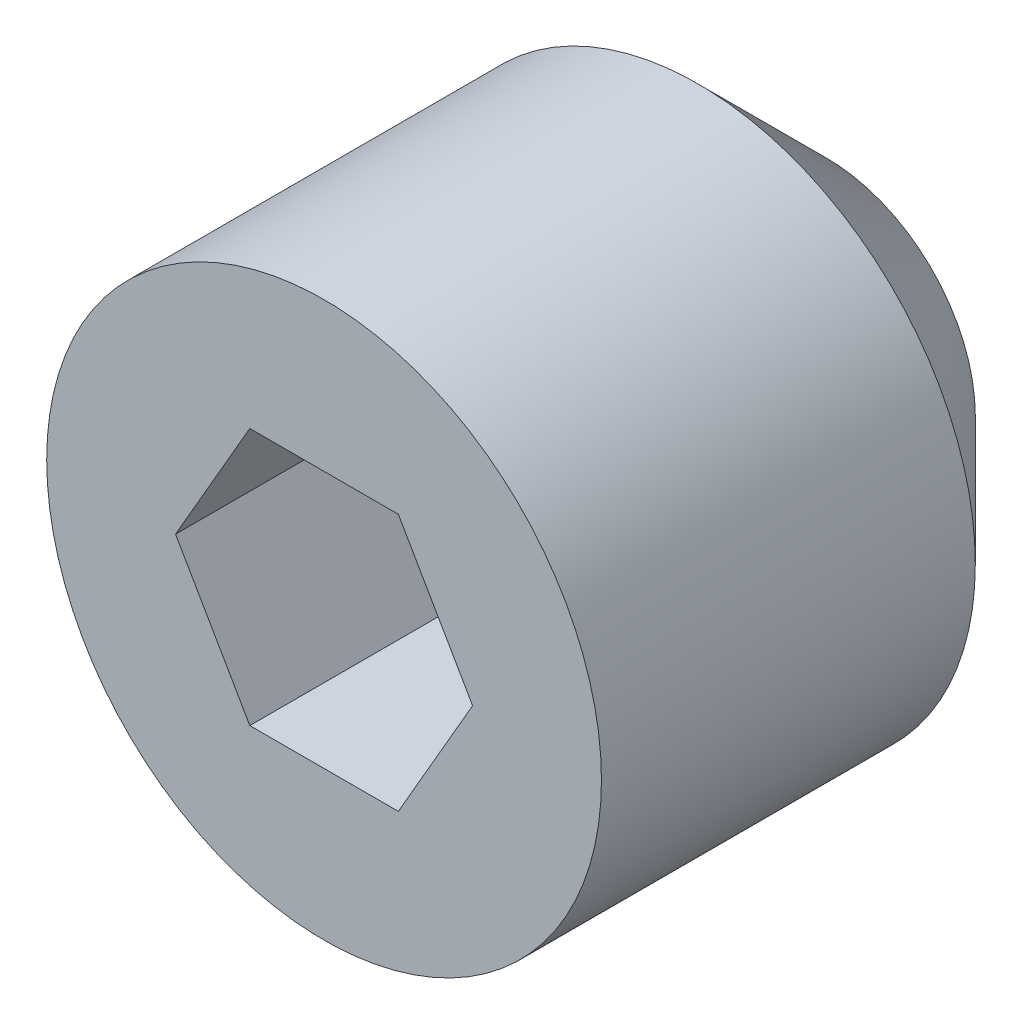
ISO-10303-21;
HEADER;
FILE_DESCRIPTION(('STEP AP214'),'2;1');
FILE_NAME('part.step','',(''),(''),'','','');
FILE_SCHEMA(('AUTOMOTIVE_DESIGN { 1 0 10303 214 1 1 1 1 }'));
ENDSEC;
DATA;
#1=APPLICATION_CONTEXT('core data for automotive mechanical design processes');
#2=APPLICATION_PROTOCOL_DEFINITION('international standard','automotive_design',2000,#1);
#3=PRODUCT_CONTEXT('',#1,'mechanical');
#4=PRODUCT('Part','Part','',(#3));
#5=PRODUCT_RELATED_PRODUCT_CATEGORY('part','',(#4));
#6=PRODUCT_DEFINITION_FORMATION('','',#4);
#7=PRODUCT_DEFINITION_CONTEXT('part definition',#1,'design');
#8=PRODUCT_DEFINITION('design','',#6,#7);
#9=PRODUCT_DEFINITION_SHAPE('','',#8);
#10=(LENGTH_UNIT() NAMED_UNIT(*) SI_UNIT(.MILLI.,.METRE.));
#11=(NAMED_UNIT(*) PLANE_ANGLE_UNIT() SI_UNIT($,.RADIAN.));
#12=(NAMED_UNIT(*) SI_UNIT($,.STERADIAN.) SOLID_ANGLE_UNIT());
#13=UNCERTAINTY_MEASURE_WITH_UNIT(LENGTH_MEASURE(1.E-05),#10,'distance_accuracy_value','');
#14=(GEOMETRIC_REPRESENTATION_CONTEXT(3) GLOBAL_UNCERTAINTY_ASSIGNED_CONTEXT((#13)) GLOBAL_UNIT_ASSIGNED_CONTEXT((#10,
#11,#12)) REPRESENTATION_CONTEXT('',''));
#15=CARTESIAN_POINT('',(0.,0.,0.));
#16=DIRECTION('',(0.,0.,1.));
#17=DIRECTION('',(1.,0.,0.));
#18=AXIS2_PLACEMENT_3D('',#15,#16,#17);
#19=CARTESIAN_POINT('',(0.,0.,0.));
#20=DIRECTION('',(0.,0.,-1.));
#21=DIRECTION('',(-1.,0.,0.));
#22=AXIS2_PLACEMENT_3D('',#19,#20,#21);
#23=PLANE('',#22);
#24=DIRECTION('',(-0.5,0.866025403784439,0.));
#25=VECTOR('',#24,1.);
#26=CARTESIAN_POINT('',(0.938540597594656,0.,0.));
#27=LINE('',#26,#25);
#28=CARTESIAN_POINT('',(0.938540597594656,0.,0.));
#29=VERTEX_POINT('',#28);
#30=CARTESIAN_POINT('',(0.469270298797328,0.8128,0.));
#31=VERTEX_POINT('',#30);
#32=EDGE_CURVE('E98',#29,#31,#27,.T.);
#33=ORIENTED_EDGE('',*,*,#32,.F.);
#34=DIRECTION('',(0.5,0.866025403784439,0.));
#35=VECTOR('',#34,1.);
#36=CARTESIAN_POINT('',(0.469270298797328,-0.8128,0.));
#37=LINE('',#36,#35);
#38=CARTESIAN_POINT('',(0.469270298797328,-0.8128,0.));
#39=VERTEX_POINT('',#38);
#40=EDGE_CURVE('E44',#39,#29,#37,.T.);
#41=ORIENTED_EDGE('',*,*,#40,.F.);
#42=DIRECTION('',(1.,0.,0.));
#43=VECTOR('',#42,1.);
#44=CARTESIAN_POINT('',(-0.469270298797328,-0.8128,0.));
#45=LINE('',#44,#43);
#46=CARTESIAN_POINT('',(-0.469270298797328,-0.8128,0.));
#47=VERTEX_POINT('',#46);
#48=EDGE_CURVE('E113',#47,#39,#45,.T.);
#49=ORIENTED_EDGE('',*,*,#48,.F.);
#50=DIRECTION('',(0.5,-0.866025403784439,0.));
#51=VECTOR('',#50,1.);
#52=CARTESIAN_POINT('',(-0.938540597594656,0.,0.));
#53=LINE('',#52,#51);
#54=CARTESIAN_POINT('',(-0.938540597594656,0.,0.));
#55=VERTEX_POINT('',#54);
#56=EDGE_CURVE('E107',#55,#47,#53,.T.);
#57=ORIENTED_EDGE('',*,*,#56,.F.);
#58=DIRECTION('',(-0.5,-0.866025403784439,0.));
#59=VECTOR('',#58,1.);
#60=CARTESIAN_POINT('',(-0.469270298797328,0.8128,0.));
#61=LINE('',#60,#59);
#62=CARTESIAN_POINT('',(-0.469270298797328,0.8128,0.));
#63=VERTEX_POINT('',#62);
#64=EDGE_CURVE('E105',#63,#55,#61,.T.);
#65=ORIENTED_EDGE('',*,*,#64,.F.);
#66=DIRECTION('',(-1.,0.,0.));
#67=VECTOR('',#66,1.);
#68=CARTESIAN_POINT('',(0.469270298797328,0.8128,0.));
#69=LINE('',#68,#67);
#70=EDGE_CURVE('E87',#31,#63,#69,.T.);
#71=ORIENTED_EDGE('',*,*,#70,.F.);
#72=EDGE_LOOP('',(#33,#41,#49,#57,#65,#71));
#73=FACE_BOUND('',#72,.T.);
#74=CARTESIAN_POINT('',(0.,0.,0.));
#75=DIRECTION('',(0.,0.,1.));
#76=DIRECTION('',(1.,0.,0.));
#77=AXIS2_PLACEMENT_3D('',#74,#75,#76);
#78=CIRCLE('',#77,1.7526);
#79=CARTESIAN_POINT('',(1.7526,0.,0.));
#80=VERTEX_POINT('',#79);
#81=EDGE_CURVE('E11',#80,#80,#78,.T.);
#82=ORIENTED_EDGE('',*,*,#81,.T.);
#83=EDGE_LOOP('',(#82));
#84=FACE_BOUND('',#83,.T.);
#85=ADVANCED_FACE('F30',(#73,#84),#23,.F.);
#86=CARTESIAN_POINT('',(0.,0.,19.7862277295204));
#87=DIRECTION('',(0.,0.,1.));
#88=DIRECTION('',(1.,0.,0.));
#89=AXIS2_PLACEMENT_3D('',#86,#87,#88);
#90=CYLINDRICAL_SURFACE('',#89,1.7526);
#91=ORIENTED_EDGE('',*,*,#81,.F.);
#92=EDGE_LOOP('',(#91));
#93=FACE_BOUND('',#92,.T.);
#94=CARTESIAN_POINT('',(0.,0.,-2.3622));
#95=DIRECTION('',(0.,0.,1.));
#96=DIRECTION('',(1.,0.,0.));
#97=AXIS2_PLACEMENT_3D('',#94,#95,#96);
#98=CIRCLE('',#97,1.7526);
#99=CARTESIAN_POINT('',(1.7526,0.,-2.3622));
#100=VERTEX_POINT('',#99);
#101=EDGE_CURVE('E37',#100,#100,#98,.T.);
#102=ORIENTED_EDGE('',*,*,#101,.T.);
#103=EDGE_LOOP('',(#102));
#104=FACE_BOUND('',#103,.T.);
#105=ADVANCED_FACE('F142',(#93,#104),#90,.T.);
#106=CARTESIAN_POINT('',(0.,0.,-3.175));
#107=DIRECTION('',(0.,0.,1.));
#108=DIRECTION('',(1.,0.,0.));
#109=AXIS2_PLACEMENT_3D('',#106,#107,#108);
#110=CONICAL_SURFACE('',#109,0.9398,0.785398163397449);
#111=ORIENTED_EDGE('',*,*,#101,.F.);
#112=EDGE_LOOP('',(#111));
#113=FACE_BOUND('',#112,.T.);
#114=CARTESIAN_POINT('',(0.,0.,-3.175));
#115=DIRECTION('',(0.,0.,1.));
#116=DIRECTION('',(1.,0.,0.));
#117=AXIS2_PLACEMENT_3D('',#114,#115,#116);
#118=CIRCLE('',#117,0.9398);
#119=CARTESIAN_POINT('',(0.9398,0.,-3.175));
#120=VERTEX_POINT('',#119);
#121=EDGE_CURVE('E131',#120,#120,#118,.T.);
#122=ORIENTED_EDGE('',*,*,#121,.T.);
#123=EDGE_LOOP('',(#122));
#124=FACE_BOUND('',#123,.T.);
#125=ADVANCED_FACE('F144',(#113,#124),#110,.T.);
#126=CARTESIAN_POINT('',(0.,0.9398,-3.175));
#127=DIRECTION('',(0.,0.,1.));
#128=DIRECTION('',(1.,0.,0.));
#129=AXIS2_PLACEMENT_3D('',#126,#127,#128);
#130=PLANE('',#129);
#131=ORIENTED_EDGE('',*,*,#121,.F.);
#132=EDGE_LOOP('',(#131));
#133=FACE_BOUND('',#132,.T.);
#134=ADVANCED_FACE('F147',(#133),#130,.F.);
#135=CARTESIAN_POINT('',(0.469270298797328,-0.8128,-1.27));
#136=DIRECTION('',(0.866025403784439,-0.5,0.));
#137=DIRECTION('',(0.5,0.866025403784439,0.));
#138=AXIS2_PLACEMENT_3D('',#135,#136,#137);
#139=PLANE('',#138);
#140=ORIENTED_EDGE('',*,*,#40,.T.);
#141=DIRECTION('',(0.,0.,1.));
#142=VECTOR('',#141,1.);
#143=CARTESIAN_POINT('',(0.938540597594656,0.,-1.27));
#144=LINE('',#143,#142);
#145=CARTESIAN_POINT('',(0.938540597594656,0.,-1.27));
#146=VERTEX_POINT('',#145);
#147=EDGE_CURVE('E95',#146,#29,#144,.T.);
#148=ORIENTED_EDGE('',*,*,#147,.F.);
#149=DIRECTION('',(0.5,0.866025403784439,0.));
#150=VECTOR('',#149,1.);
#151=CARTESIAN_POINT('',(0.469270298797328,-0.8128,-1.27));
#152=LINE('',#151,#150);
#153=CARTESIAN_POINT('',(0.469270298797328,-0.8128,-1.27));
#154=VERTEX_POINT('',#153);
#155=EDGE_CURVE('E115',#154,#146,#152,.T.);
#156=ORIENTED_EDGE('',*,*,#155,.F.);
#157=DIRECTION('',(0.,0.,1.));
#158=VECTOR('',#157,1.);
#159=CARTESIAN_POINT('',(0.469270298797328,-0.8128,-1.27));
#160=LINE('',#159,#158);
#161=EDGE_CURVE('E51',#154,#39,#160,.T.);
#162=ORIENTED_EDGE('',*,*,#161,.T.);
#163=EDGE_LOOP('',(#140,#148,#156,#162));
#164=FACE_BOUND('',#163,.T.);
#165=ADVANCED_FACE('F152',(#164),#139,.F.);
#166=CARTESIAN_POINT('',(-0.469270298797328,-0.8128,-1.27));
#167=DIRECTION('',(0.,-1.,0.));
#168=DIRECTION('',(1.,0.,0.));
#169=AXIS2_PLACEMENT_3D('',#166,#167,#168);
#170=PLANE('',#169);
#171=ORIENTED_EDGE('',*,*,#48,.T.);
#172=ORIENTED_EDGE('',*,*,#161,.F.);
#173=DIRECTION('',(1.,0.,0.));
#174=VECTOR('',#173,1.);
#175=CARTESIAN_POINT('',(-0.469270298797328,-0.8128,-1.27));
#176=LINE('',#175,#174);
#177=CARTESIAN_POINT('',(-0.469270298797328,-0.8128,-1.27));
#178=VERTEX_POINT('',#177);
#179=EDGE_CURVE('E127',#178,#154,#176,.T.);
#180=ORIENTED_EDGE('',*,*,#179,.F.);
#181=DIRECTION('',(0.,0.,1.));
#182=VECTOR('',#181,1.);
#183=CARTESIAN_POINT('',(-0.469270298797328,-0.8128,-1.27));
#184=LINE('',#183,#182);
#185=EDGE_CURVE('E132',#178,#47,#184,.T.);
#186=ORIENTED_EDGE('',*,*,#185,.T.);
#187=EDGE_LOOP('',(#171,#172,#180,#186));
#188=FACE_BOUND('',#187,.T.);
#189=ADVANCED_FACE('F157',(#188),#170,.F.);
#190=CARTESIAN_POINT('',(-0.938540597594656,0.,-1.27));
#191=DIRECTION('',(-0.866025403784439,-0.5,0.));
#192=DIRECTION('',(0.5,-0.866025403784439,0.));
#193=AXIS2_PLACEMENT_3D('',#190,#191,#192);
#194=PLANE('',#193);
#195=ORIENTED_EDGE('',*,*,#56,.T.);
#196=ORIENTED_EDGE('',*,*,#185,.F.);
#197=DIRECTION('',(0.5,-0.866025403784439,0.));
#198=VECTOR('',#197,1.);
#199=CARTESIAN_POINT('',(-0.938540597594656,0.,-1.27));
#200=LINE('',#199,#198);
#201=CARTESIAN_POINT('',(-0.938540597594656,0.,-1.27));
#202=VERTEX_POINT('',#201);
#203=EDGE_CURVE('E124',#202,#178,#200,.T.);
#204=ORIENTED_EDGE('',*,*,#203,.F.);
#205=DIRECTION('',(0.,0.,1.));
#206=VECTOR('',#205,1.);
#207=CARTESIAN_POINT('',(-0.938540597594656,0.,-1.27));
#208=LINE('',#207,#206);
#209=EDGE_CURVE('E134',#202,#55,#208,.T.);
#210=ORIENTED_EDGE('',*,*,#209,.T.);
#211=EDGE_LOOP('',(#195,#196,#204,#210));
#212=FACE_BOUND('',#211,.T.);
#213=ADVANCED_FACE('F194',(#212),#194,.F.);
#214=CARTESIAN_POINT('',(-0.469270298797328,0.8128,-1.27));
#215=DIRECTION('',(-0.866025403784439,0.5,0.));
#216=DIRECTION('',(-0.5,-0.866025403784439,0.));
#217=AXIS2_PLACEMENT_3D('',#214,#215,#216);
#218=PLANE('',#217);
#219=ORIENTED_EDGE('',*,*,#64,.T.);
#220=ORIENTED_EDGE('',*,*,#209,.F.);
#221=DIRECTION('',(-0.5,-0.866025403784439,0.));
#222=VECTOR('',#221,1.);
#223=CARTESIAN_POINT('',(-0.469270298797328,0.8128,-1.27));
#224=LINE('',#223,#222);
#225=CARTESIAN_POINT('',(-0.469270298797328,0.8128,-1.27));
#226=VERTEX_POINT('',#225);
#227=EDGE_CURVE('E121',#226,#202,#224,.T.);
#228=ORIENTED_EDGE('',*,*,#227,.F.);
#229=DIRECTION('',(0.,0.,1.));
#230=VECTOR('',#229,1.);
#231=CARTESIAN_POINT('',(-0.469270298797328,0.8128,-1.27));
#232=LINE('',#231,#230);
#233=EDGE_CURVE('E94',#226,#63,#232,.T.);
#234=ORIENTED_EDGE('',*,*,#233,.T.);
#235=EDGE_LOOP('',(#219,#220,#228,#234));
#236=FACE_BOUND('',#235,.T.);
#237=ADVANCED_FACE('F203',(#236),#218,.F.);
#238=CARTESIAN_POINT('',(0.469270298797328,0.8128,-1.27));
#239=DIRECTION('',(0.,1.,0.));
#240=DIRECTION('',(-1.,0.,0.));
#241=AXIS2_PLACEMENT_3D('',#238,#239,#240);
#242=PLANE('',#241);
#243=ORIENTED_EDGE('',*,*,#70,.T.);
#244=ORIENTED_EDGE('',*,*,#233,.F.);
#245=DIRECTION('',(-1.,0.,0.));
#246=VECTOR('',#245,1.);
#247=CARTESIAN_POINT('',(0.469270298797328,0.8128,-1.27));
#248=LINE('',#247,#246);
#249=CARTESIAN_POINT('',(0.469270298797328,0.8128,-1.27));
#250=VERTEX_POINT('',#249);
#251=EDGE_CURVE('E90',#250,#226,#248,.T.);
#252=ORIENTED_EDGE('',*,*,#251,.F.);
#253=DIRECTION('',(0.,0.,1.));
#254=VECTOR('',#253,1.);
#255=CARTESIAN_POINT('',(0.469270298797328,0.8128,-1.27));
#256=LINE('',#255,#254);
#257=EDGE_CURVE('E83',#250,#31,#256,.T.);
#258=ORIENTED_EDGE('',*,*,#257,.T.);
#259=EDGE_LOOP('',(#243,#244,#252,#258));
#260=FACE_BOUND('',#259,.T.);
#261=ADVANCED_FACE('F85',(#260),#242,.F.);
#262=CARTESIAN_POINT('',(0.938540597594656,0.,-1.27));
#263=DIRECTION('',(0.866025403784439,0.5,0.));
#264=DIRECTION('',(-0.5,0.866025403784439,0.));
#265=AXIS2_PLACEMENT_3D('',#262,#263,#264);
#266=PLANE('',#265);
#267=ORIENTED_EDGE('',*,*,#32,.T.);
#268=ORIENTED_EDGE('',*,*,#257,.F.);
#269=DIRECTION('',(-0.5,0.866025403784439,0.));
#270=VECTOR('',#269,1.);
#271=CARTESIAN_POINT('',(0.938540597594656,0.,-1.27));
#272=LINE('',#271,#270);
#273=EDGE_CURVE('E118',#146,#250,#272,.T.);
#274=ORIENTED_EDGE('',*,*,#273,.F.);
#275=ORIENTED_EDGE('',*,*,#147,.T.);
#276=EDGE_LOOP('',(#267,#268,#274,#275));
#277=FACE_BOUND('',#276,.T.);
#278=ADVANCED_FACE('F99',(#277),#266,.F.);
#279=CARTESIAN_POINT('',(0.469270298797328,-0.8128,-1.27));
#280=DIRECTION('',(0.,0.,-1.));
#281=DIRECTION('',(-1.,0.,0.));
#282=AXIS2_PLACEMENT_3D('',#279,#280,#281);
#283=PLANE('',#282);
#284=ORIENTED_EDGE('',*,*,#155,.T.);
#285=ORIENTED_EDGE('',*,*,#273,.T.);
#286=ORIENTED_EDGE('',*,*,#251,.T.);
#287=ORIENTED_EDGE('',*,*,#227,.T.);
#288=ORIENTED_EDGE('',*,*,#203,.T.);
#289=ORIENTED_EDGE('',*,*,#179,.T.);
#290=EDGE_LOOP('',(#284,#285,#286,#287,#288,#289));
#291=FACE_BOUND('',#290,.T.);
#292=ADVANCED_FACE('F230',(#291),#283,.F.);
#293=CLOSED_SHELL('',(#85,#105,#125,#134,#165,#189,#213,#237,#261,#278,#292));
#294=MANIFOLD_SOLID_BREP('B2',#293);
#295=ADVANCED_BREP_SHAPE_REPRESENTATION('',(#18,#294),#14);
#296=SHAPE_DEFINITION_REPRESENTATION(#9,#295);
ENDSEC;
END-ISO-10303-21;
